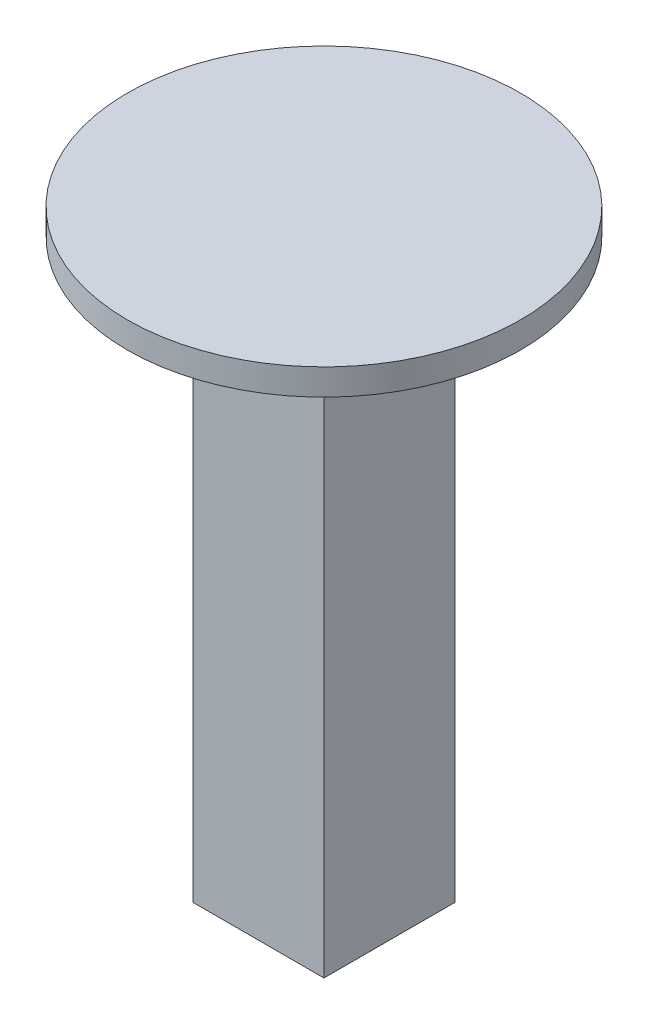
ISO-10303-21;
HEADER;
FILE_DESCRIPTION(('STEP AP214'),'2;1');
FILE_NAME('part.step','',(''),(''),'','','');
FILE_SCHEMA(('AUTOMOTIVE_DESIGN { 1 0 10303 214 1 1 1 1 }'));
ENDSEC;
DATA;
#1=APPLICATION_CONTEXT('core data for automotive mechanical design processes');
#2=APPLICATION_PROTOCOL_DEFINITION('international standard','automotive_design',2000,#1);
#3=PRODUCT_CONTEXT('',#1,'mechanical');
#4=PRODUCT('Part','Part','',(#3));
#5=PRODUCT_RELATED_PRODUCT_CATEGORY('part','',(#4));
#6=PRODUCT_DEFINITION_FORMATION('','',#4);
#7=PRODUCT_DEFINITION_CONTEXT('part definition',#1,'design');
#8=PRODUCT_DEFINITION('design','',#6,#7);
#9=PRODUCT_DEFINITION_SHAPE('','',#8);
#10=(LENGTH_UNIT() NAMED_UNIT(*) SI_UNIT(.MILLI.,.METRE.));
#11=(NAMED_UNIT(*) PLANE_ANGLE_UNIT() SI_UNIT($,.RADIAN.));
#12=(NAMED_UNIT(*) SI_UNIT($,.STERADIAN.) SOLID_ANGLE_UNIT());
#13=UNCERTAINTY_MEASURE_WITH_UNIT(LENGTH_MEASURE(1.E-05),#10,'distance_accuracy_value','');
#14=(GEOMETRIC_REPRESENTATION_CONTEXT(3) GLOBAL_UNCERTAINTY_ASSIGNED_CONTEXT((#13)) GLOBAL_UNIT_ASSIGNED_CONTEXT((#10,
#11,#12)) REPRESENTATION_CONTEXT('',''));
#15=CARTESIAN_POINT('',(0.,0.,0.));
#16=DIRECTION('',(0.,0.,1.));
#17=DIRECTION('',(1.,0.,0.));
#18=AXIS2_PLACEMENT_3D('',#15,#16,#17);
#19=CARTESIAN_POINT('',(-25.,50.,-25.));
#20=DIRECTION('',(1.,0.,0.));
#21=DIRECTION('',(0.,0.,-1.));
#22=AXIS2_PLACEMENT_3D('',#19,#20,#21);
#23=PLANE('',#22);
#24=DIRECTION('',(0.,0.,1.));
#25=VECTOR('',#24,1.);
#26=CARTESIAN_POINT('',(-25.,220.,-25.));
#27=LINE('',#26,#25);
#28=CARTESIAN_POINT('',(-25.,220.,-25.));
#29=VERTEX_POINT('',#28);
#30=CARTESIAN_POINT('',(-25.,220.,25.));
#31=VERTEX_POINT('',#30);
#32=EDGE_CURVE('E113',#29,#31,#27,.T.);
#33=ORIENTED_EDGE('',*,*,#32,.F.);
#34=DIRECTION('',(0.,-1.,0.));
#35=VECTOR('',#34,1.);
#36=CARTESIAN_POINT('',(-25.,50.,-25.));
#37=LINE('',#36,#35);
#38=CARTESIAN_POINT('',(-25.,0.,-25.));
#39=VERTEX_POINT('',#38);
#40=EDGE_CURVE('E121',#29,#39,#37,.T.);
#41=ORIENTED_EDGE('',*,*,#40,.T.);
#42=DIRECTION('',(0.,0.,1.));
#43=VECTOR('',#42,1.);
#44=CARTESIAN_POINT('',(-25.,0.,-25.));
#45=LINE('',#44,#43);
#46=CARTESIAN_POINT('',(-25.,0.,25.));
#47=VERTEX_POINT('',#46);
#48=EDGE_CURVE('E193',#39,#47,#45,.T.);
#49=ORIENTED_EDGE('',*,*,#48,.T.);
#50=DIRECTION('',(0.,-1.,0.));
#51=VECTOR('',#50,1.);
#52=CARTESIAN_POINT('',(-25.,50.,25.));
#53=LINE('',#52,#51);
#54=EDGE_CURVE('E123',#31,#47,#53,.T.);
#55=ORIENTED_EDGE('',*,*,#54,.F.);
#56=EDGE_LOOP('',(#33,#41,#49,#55));
#57=FACE_BOUND('',#56,.T.);
#58=ADVANCED_FACE('F48',(#57),#23,.F.);
#59=CARTESIAN_POINT('',(-25.,50.,25.));
#60=DIRECTION('',(0.,0.,-1.));
#61=DIRECTION('',(-1.,0.,0.));
#62=AXIS2_PLACEMENT_3D('',#59,#60,#61);
#63=PLANE('',#62);
#64=DIRECTION('',(1.,0.,0.));
#65=VECTOR('',#64,1.);
#66=CARTESIAN_POINT('',(-25.,220.,25.));
#67=LINE('',#66,#65);
#68=CARTESIAN_POINT('',(25.,220.,25.));
#69=VERTEX_POINT('',#68);
#70=EDGE_CURVE('E126',#31,#69,#67,.T.);
#71=ORIENTED_EDGE('',*,*,#70,.F.);
#72=ORIENTED_EDGE('',*,*,#54,.T.);
#73=DIRECTION('',(1.,0.,0.));
#74=VECTOR('',#73,1.);
#75=CARTESIAN_POINT('',(-25.,0.,25.));
#76=LINE('',#75,#74);
#77=CARTESIAN_POINT('',(25.,0.,25.));
#78=VERTEX_POINT('',#77);
#79=EDGE_CURVE('E196',#47,#78,#76,.T.);
#80=ORIENTED_EDGE('',*,*,#79,.T.);
#81=DIRECTION('',(0.,-1.,0.));
#82=VECTOR('',#81,1.);
#83=CARTESIAN_POINT('',(25.,50.,25.));
#84=LINE('',#83,#82);
#85=EDGE_CURVE('E137',#69,#78,#84,.T.);
#86=ORIENTED_EDGE('',*,*,#85,.F.);
#87=EDGE_LOOP('',(#71,#72,#80,#86));
#88=FACE_BOUND('',#87,.T.);
#89=ADVANCED_FACE('F209',(#88),#63,.F.);
#90=CARTESIAN_POINT('',(25.,50.,-25.));
#91=DIRECTION('',(1.,0.,0.));
#92=DIRECTION('',(0.,0.,-1.));
#93=AXIS2_PLACEMENT_3D('',#90,#91,#92);
#94=PLANE('',#93);
#95=DIRECTION('',(0.,-1.,0.));
#96=VECTOR('',#95,1.);
#97=CARTESIAN_POINT('',(25.,50.,-25.));
#98=LINE('',#97,#96);
#99=CARTESIAN_POINT('',(25.,220.,-25.));
#100=VERTEX_POINT('',#99);
#101=CARTESIAN_POINT('',(25.,0.,-25.));
#102=VERTEX_POINT('',#101);
#103=EDGE_CURVE('E133',#100,#102,#98,.T.);
#104=ORIENTED_EDGE('',*,*,#103,.F.);
#105=DIRECTION('',(0.,0.,1.));
#106=VECTOR('',#105,1.);
#107=CARTESIAN_POINT('',(25.,220.,-25.));
#108=LINE('',#107,#106);
#109=EDGE_CURVE('E64',#100,#69,#108,.T.);
#110=ORIENTED_EDGE('',*,*,#109,.T.);
#111=ORIENTED_EDGE('',*,*,#85,.T.);
#112=DIRECTION('',(0.,0.,1.));
#113=VECTOR('',#112,1.);
#114=CARTESIAN_POINT('',(25.,0.,-25.));
#115=LINE('',#114,#113);
#116=EDGE_CURVE('E139',#102,#78,#115,.T.);
#117=ORIENTED_EDGE('',*,*,#116,.F.);
#118=EDGE_LOOP('',(#104,#110,#111,#117));
#119=FACE_BOUND('',#118,.T.);
#120=ADVANCED_FACE('F206',(#119),#94,.T.);
#121=CARTESIAN_POINT('',(-25.,50.,-25.));
#122=DIRECTION('',(0.,0.,-1.));
#123=DIRECTION('',(-1.,0.,0.));
#124=AXIS2_PLACEMENT_3D('',#121,#122,#123);
#125=PLANE('',#124);
#126=ORIENTED_EDGE('',*,*,#40,.F.);
#127=DIRECTION('',(1.,0.,0.));
#128=VECTOR('',#127,1.);
#129=CARTESIAN_POINT('',(-25.,220.,-25.));
#130=LINE('',#129,#128);
#131=EDGE_CURVE('E11',#29,#100,#130,.T.);
#132=ORIENTED_EDGE('',*,*,#131,.T.);
#133=ORIENTED_EDGE('',*,*,#103,.T.);
#134=DIRECTION('',(1.,0.,0.));
#135=VECTOR('',#134,1.);
#136=CARTESIAN_POINT('',(-25.,0.,-25.));
#137=LINE('',#136,#135);
#138=EDGE_CURVE('E131',#39,#102,#137,.T.);
#139=ORIENTED_EDGE('',*,*,#138,.F.);
#140=EDGE_LOOP('',(#126,#132,#133,#139));
#141=FACE_BOUND('',#140,.T.);
#142=ADVANCED_FACE('F129',(#141),#125,.T.);
#143=CARTESIAN_POINT('',(0.,0.,0.));
#144=DIRECTION('',(0.,1.,0.));
#145=DIRECTION('',(0.,0.,1.));
#146=AXIS2_PLACEMENT_3D('',#143,#144,#145);
#147=PLANE('',#146);
#148=CARTESIAN_POINT('',(0.,0.,0.));
#149=DIRECTION('',(0.,-1.,0.));
#150=DIRECTION('',(0.,0.,-1.));
#151=AXIS2_PLACEMENT_3D('',#148,#149,#150);
#152=CIRCLE('',#151,4.);
#153=CARTESIAN_POINT('',(0.,0.,-4.));
#154=VERTEX_POINT('',#153);
#155=EDGE_CURVE('E336',#154,#154,#152,.T.);
#156=ORIENTED_EDGE('',*,*,#155,.F.);
#157=EDGE_LOOP('',(#156));
#158=FACE_BOUND('',#157,.T.);
#159=ORIENTED_EDGE('',*,*,#48,.F.);
#160=ORIENTED_EDGE('',*,*,#138,.T.);
#161=ORIENTED_EDGE('',*,*,#116,.T.);
#162=ORIENTED_EDGE('',*,*,#79,.F.);
#163=EDGE_LOOP('',(#159,#160,#161,#162));
#164=FACE_BOUND('',#163,.T.);
#165=ADVANCED_FACE('F204',(#158,#164),#147,.F.);
#166=CARTESIAN_POINT('',(0.,220.,0.));
#167=DIRECTION('',(0.,1.,0.));
#168=DIRECTION('',(0.,0.,1.));
#169=AXIS2_PLACEMENT_3D('',#166,#167,#168);
#170=PLANE('',#169);
#171=CARTESIAN_POINT('',(0.,220.,0.));
#172=DIRECTION('',(0.,1.,0.));
#173=DIRECTION('',(0.,0.,1.));
#174=AXIS2_PLACEMENT_3D('',#171,#172,#173);
#175=CIRCLE('',#174,75.);
#176=CARTESIAN_POINT('',(0.,220.,75.));
#177=VERTEX_POINT('',#176);
#178=EDGE_CURVE('E213',#177,#177,#175,.T.);
#179=ORIENTED_EDGE('',*,*,#178,.F.);
#180=EDGE_LOOP('',(#179));
#181=FACE_BOUND('',#180,.T.);
#182=ORIENTED_EDGE('',*,*,#131,.F.);
#183=ORIENTED_EDGE('',*,*,#32,.T.);
#184=ORIENTED_EDGE('',*,*,#70,.T.);
#185=ORIENTED_EDGE('',*,*,#109,.F.);
#186=EDGE_LOOP('',(#182,#183,#184,#185));
#187=FACE_BOUND('',#186,.T.);
#188=ADVANCED_FACE('F112',(#181,#187),#170,.F.);
#189=CARTESIAN_POINT('',(0.,220.,0.));
#190=DIRECTION('',(0.,1.,0.));
#191=DIRECTION('',(0.,0.,1.));
#192=AXIS2_PLACEMENT_3D('',#189,#190,#191);
#193=CYLINDRICAL_SURFACE('',#192,75.);
#194=ORIENTED_EDGE('',*,*,#178,.T.);
#195=EDGE_LOOP('',(#194));
#196=FACE_BOUND('',#195,.T.);
#197=CARTESIAN_POINT('',(0.,230.,0.));
#198=DIRECTION('',(0.,1.,0.));
#199=DIRECTION('',(0.,0.,1.));
#200=AXIS2_PLACEMENT_3D('',#197,#198,#199);
#201=CIRCLE('',#200,75.);
#202=CARTESIAN_POINT('',(0.,230.,75.));
#203=VERTEX_POINT('',#202);
#204=EDGE_CURVE('E335',#203,#203,#201,.T.);
#205=ORIENTED_EDGE('',*,*,#204,.F.);
#206=EDGE_LOOP('',(#205));
#207=FACE_BOUND('',#206,.T.);
#208=ADVANCED_FACE('F283',(#196,#207),#193,.T.);
#209=CARTESIAN_POINT('',(0.,230.,0.));
#210=DIRECTION('',(0.,1.,0.));
#211=DIRECTION('',(0.,0.,1.));
#212=AXIS2_PLACEMENT_3D('',#209,#210,#211);
#213=PLANE('',#212);
#214=ORIENTED_EDGE('',*,*,#204,.T.);
#215=EDGE_LOOP('',(#214));
#216=FACE_BOUND('',#215,.T.);
#217=ADVANCED_FACE('F243',(#216),#213,.T.);
#218=CARTESIAN_POINT('',(0.,22.,0.));
#219=DIRECTION('',(0.,-1.,0.));
#220=DIRECTION('',(0.,0.,-1.));
#221=AXIS2_PLACEMENT_3D('',#218,#219,#220);
#222=CYLINDRICAL_SURFACE('',#221,4.);
#223=CARTESIAN_POINT('',(0.,22.,0.));
#224=DIRECTION('',(0.,-1.,0.));
#225=DIRECTION('',(0.,0.,-1.));
#226=AXIS2_PLACEMENT_3D('',#223,#224,#225);
#227=CIRCLE('',#226,4.);
#228=CARTESIAN_POINT('',(0.,22.,-4.));
#229=VERTEX_POINT('',#228);
#230=EDGE_CURVE('E333',#229,#229,#227,.T.);
#231=ORIENTED_EDGE('',*,*,#230,.F.);
#232=EDGE_LOOP('',(#231));
#233=FACE_BOUND('',#232,.T.);
#234=ORIENTED_EDGE('',*,*,#155,.T.);
#235=EDGE_LOOP('',(#234));
#236=FACE_BOUND('',#235,.T.);
#237=ADVANCED_FACE('F298',(#233,#236),#222,.F.);
#238=CARTESIAN_POINT('',(0.,22.,0.));
#239=DIRECTION('',(0.,-1.,0.));
#240=DIRECTION('',(0.,0.,-1.));
#241=AXIS2_PLACEMENT_3D('',#238,#239,#240);
#242=PLANE('',#241);
#243=ORIENTED_EDGE('',*,*,#230,.T.);
#244=EDGE_LOOP('',(#243));
#245=FACE_BOUND('',#244,.T.);
#246=ADVANCED_FACE('F314',(#245),#242,.T.);
#247=CLOSED_SHELL('',(#58,#89,#120,#142,#165,#188,#208,#217,#237,#246));
#248=CARTESIAN_POINT('',(0.,180.,0.));
#249=DIRECTION('',(0.,1.,0.));
#250=DIRECTION('',(0.,0.,1.));
#251=AXIS2_PLACEMENT_3D('',#248,#249,#250);
#252=PLANE('',#251);
#253=DIRECTION('',(0.,0.,1.));
#254=VECTOR('',#253,1.);
#255=CARTESIAN_POINT('',(-20.,180.,-25.));
#256=LINE('',#255,#254);
#257=CARTESIAN_POINT('',(-20.,180.,-20.));
#258=VERTEX_POINT('',#257);
#259=CARTESIAN_POINT('',(-20.,180.,20.));
#260=VERTEX_POINT('',#259);
#261=EDGE_CURVE('E160',#258,#260,#256,.T.);
#262=ORIENTED_EDGE('',*,*,#261,.F.);
#263=DIRECTION('',(-1.,0.,0.));
#264=VECTOR('',#263,1.);
#265=CARTESIAN_POINT('',(25.,180.,-20.));
#266=LINE('',#265,#264);
#267=CARTESIAN_POINT('',(20.,180.,-20.));
#268=VERTEX_POINT('',#267);
#269=EDGE_CURVE('E187',#268,#258,#266,.T.);
#270=ORIENTED_EDGE('',*,*,#269,.F.);
#271=DIRECTION('',(0.,0.,-1.));
#272=VECTOR('',#271,1.);
#273=CARTESIAN_POINT('',(20.,180.,25.));
#274=LINE('',#273,#272);
#275=CARTESIAN_POINT('',(20.,180.,20.));
#276=VERTEX_POINT('',#275);
#277=EDGE_CURVE('E173',#276,#268,#274,.T.);
#278=ORIENTED_EDGE('',*,*,#277,.F.);
#279=DIRECTION('',(-1.,0.,0.));
#280=VECTOR('',#279,1.);
#281=CARTESIAN_POINT('',(25.,180.,20.));
#282=LINE('',#281,#280);
#283=EDGE_CURVE('E165',#276,#260,#282,.T.);
#284=ORIENTED_EDGE('',*,*,#283,.T.);
#285=EDGE_LOOP('',(#262,#270,#278,#284));
#286=FACE_BOUND('',#285,.T.);
#287=ADVANCED_FACE('F171',(#286),#252,.F.);
#288=CARTESIAN_POINT('',(0.,50.,0.));
#289=DIRECTION('',(0.,1.,0.));
#290=DIRECTION('',(0.,0.,1.));
#291=AXIS2_PLACEMENT_3D('',#288,#289,#290);
#292=PLANE('',#291);
#293=DIRECTION('',(-1.,0.,0.));
#294=VECTOR('',#293,1.);
#295=CARTESIAN_POINT('',(25.,50.,-20.));
#296=LINE('',#295,#294);
#297=CARTESIAN_POINT('',(20.,50.,-20.));
#298=VERTEX_POINT('',#297);
#299=CARTESIAN_POINT('',(-20.,50.,-20.));
#300=VERTEX_POINT('',#299);
#301=EDGE_CURVE('E190',#298,#300,#296,.T.);
#302=ORIENTED_EDGE('',*,*,#301,.T.);
#303=DIRECTION('',(0.,0.,1.));
#304=VECTOR('',#303,1.);
#305=CARTESIAN_POINT('',(-20.,50.,-25.));
#306=LINE('',#305,#304);
#307=CARTESIAN_POINT('',(-20.,50.,20.));
#308=VERTEX_POINT('',#307);
#309=EDGE_CURVE('E125',#300,#308,#306,.T.);
#310=ORIENTED_EDGE('',*,*,#309,.T.);
#311=DIRECTION('',(-1.,0.,0.));
#312=VECTOR('',#311,1.);
#313=CARTESIAN_POINT('',(25.,50.,20.));
#314=LINE('',#313,#312);
#315=CARTESIAN_POINT('',(20.,50.,20.));
#316=VERTEX_POINT('',#315);
#317=EDGE_CURVE('E168',#316,#308,#314,.T.);
#318=ORIENTED_EDGE('',*,*,#317,.F.);
#319=DIRECTION('',(0.,0.,-1.));
#320=VECTOR('',#319,1.);
#321=CARTESIAN_POINT('',(20.,50.,25.));
#322=LINE('',#321,#320);
#323=EDGE_CURVE('E178',#316,#298,#322,.T.);
#324=ORIENTED_EDGE('',*,*,#323,.T.);
#325=EDGE_LOOP('',(#302,#310,#318,#324));
#326=FACE_BOUND('',#325,.T.);
#327=ADVANCED_FACE('F220',(#326),#292,.T.);
#328=CARTESIAN_POINT('',(0.,0.,20.));
#329=DIRECTION('',(0.,0.,1.));
#330=DIRECTION('',(1.,0.,0.));
#331=AXIS2_PLACEMENT_3D('',#328,#329,#330);
#332=PLANE('',#331);
#333=DIRECTION('',(0.,-1.,0.));
#334=VECTOR('',#333,1.);
#335=CARTESIAN_POINT('',(-20.,0.,20.));
#336=LINE('',#335,#334);
#337=EDGE_CURVE('E57',#260,#308,#336,.T.);
#338=ORIENTED_EDGE('',*,*,#337,.F.);
#339=ORIENTED_EDGE('',*,*,#283,.F.);
#340=DIRECTION('',(0.,-1.,0.));
#341=VECTOR('',#340,1.);
#342=CARTESIAN_POINT('',(20.,0.,20.));
#343=LINE('',#342,#341);
#344=EDGE_CURVE('E151',#276,#316,#343,.T.);
#345=ORIENTED_EDGE('',*,*,#344,.T.);
#346=ORIENTED_EDGE('',*,*,#317,.T.);
#347=EDGE_LOOP('',(#338,#339,#345,#346));
#348=FACE_BOUND('',#347,.T.);
#349=ADVANCED_FACE('F164',(#348),#332,.F.);
#350=CARTESIAN_POINT('',(20.,0.,0.));
#351=DIRECTION('',(1.,0.,0.));
#352=DIRECTION('',(0.,0.,-1.));
#353=AXIS2_PLACEMENT_3D('',#350,#351,#352);
#354=PLANE('',#353);
#355=ORIENTED_EDGE('',*,*,#344,.F.);
#356=ORIENTED_EDGE('',*,*,#277,.T.);
#357=DIRECTION('',(0.,1.,0.));
#358=VECTOR('',#357,1.);
#359=CARTESIAN_POINT('',(20.,0.,-20.));
#360=LINE('',#359,#358);
#361=EDGE_CURVE('E147',#298,#268,#360,.T.);
#362=ORIENTED_EDGE('',*,*,#361,.F.);
#363=ORIENTED_EDGE('',*,*,#323,.F.);
#364=EDGE_LOOP('',(#355,#356,#362,#363));
#365=FACE_BOUND('',#364,.T.);
#366=ADVANCED_FACE('F225',(#365),#354,.F.);
#367=CARTESIAN_POINT('',(0.,0.,-20.));
#368=DIRECTION('',(0.,0.,1.));
#369=DIRECTION('',(1.,0.,0.));
#370=AXIS2_PLACEMENT_3D('',#367,#368,#369);
#371=PLANE('',#370);
#372=ORIENTED_EDGE('',*,*,#269,.T.);
#373=DIRECTION('',(0.,-1.,0.));
#374=VECTOR('',#373,1.);
#375=CARTESIAN_POINT('',(-20.,0.,-20.));
#376=LINE('',#375,#374);
#377=EDGE_CURVE('E71',#258,#300,#376,.T.);
#378=ORIENTED_EDGE('',*,*,#377,.T.);
#379=ORIENTED_EDGE('',*,*,#301,.F.);
#380=ORIENTED_EDGE('',*,*,#361,.T.);
#381=EDGE_LOOP('',(#372,#378,#379,#380));
#382=FACE_BOUND('',#381,.T.);
#383=ADVANCED_FACE('F223',(#382),#371,.T.);
#384=CARTESIAN_POINT('',(-20.,0.,0.));
#385=DIRECTION('',(-1.,0.,0.));
#386=DIRECTION('',(0.,0.,1.));
#387=AXIS2_PLACEMENT_3D('',#384,#385,#386);
#388=PLANE('',#387);
#389=ORIENTED_EDGE('',*,*,#377,.F.);
#390=ORIENTED_EDGE('',*,*,#261,.T.);
#391=ORIENTED_EDGE('',*,*,#337,.T.);
#392=ORIENTED_EDGE('',*,*,#309,.F.);
#393=EDGE_LOOP('',(#389,#390,#391,#392));
#394=FACE_BOUND('',#393,.T.);
#395=ADVANCED_FACE('F158',(#394),#388,.F.);
#396=CLOSED_SHELL('',(#287,#327,#349,#366,#383,#395));
#397=ORIENTED_CLOSED_SHELL('',*,#396,.T.);
#398=BREP_WITH_VOIDS('B2',#247,(#397));
#399=ADVANCED_BREP_SHAPE_REPRESENTATION('',(#18,#398),#14);
#400=SHAPE_DEFINITION_REPRESENTATION(#9,#399);
ENDSEC;
END-ISO-10303-21;
